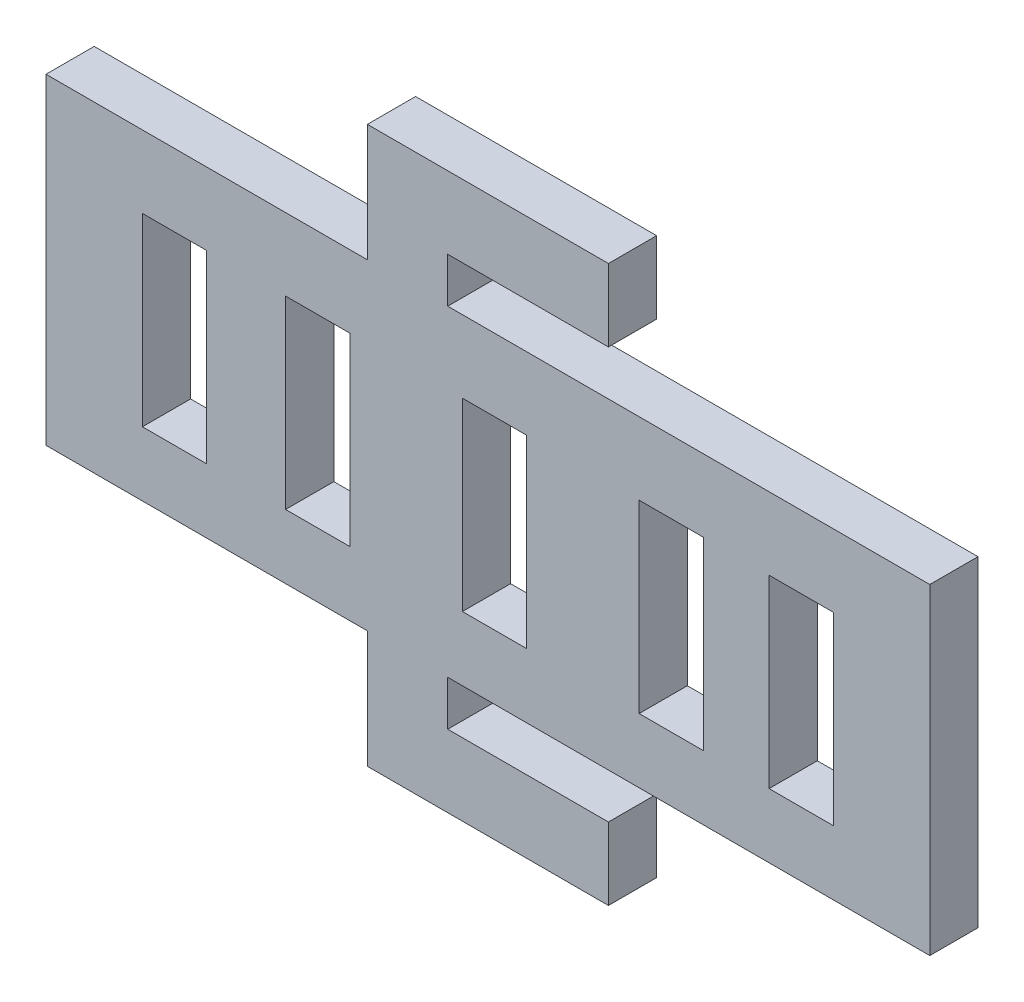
from build123d import *

# Parameters (mm, degrees)
SKETCH1_W           = 55
SKETCH1_H           = 20
SKETCH1_W_2         = 4
SKETCH1_H_2         = 11.5
BOSS_EXTRUDE1_DEPTH = 3


with BuildPart() as part:
    # Sketch1 → Boss-Extrude1 (new body)
    # profile 1 of 3: a face of its own
    with BuildSketch(Plane.XY):
        Rectangle(SKETCH1_W, SKETCH1_H)
        with Locations((-19.5, -0.25)):
            Rectangle(SKETCH1_W_2, SKETCH1_H_2, mode=Mode.SUBTRACT)
        with Locations((-10.58791266, -0.25)):
            Rectangle(SKETCH1_W_2, SKETCH1_H_2, mode=Mode.SUBTRACT)
        with Locations((0.41208734, -0.25)):
            Rectangle(SKETCH1_W_2, SKETCH1_H_2, mode=Mode.SUBTRACT)
        with Locations((11.41208734, -0.25)):
            Rectangle(SKETCH1_W_2, SKETCH1_H_2, mode=Mode.SUBTRACT)
        with Locations((19.5, -0.25)):
            Rectangle(SKETCH1_W_2, SKETCH1_H_2, mode=Mode.SUBTRACT)
    # profile 2 of 3: a face of its own
    with BuildSketch(Plane.XY):
        Polygon((-7.5, 17.3), (-7.5, 10), (-2.5, 10), (-2.5, 12.8), (7.5, 12.8), (7.5, 17.3), align=None)
    # profile 3 of 3: a face of its own
    with BuildSketch(Plane.XY):
        Polygon((-2.5, -10), (-7.5, -10), (-7.5, -17.3), (7.5, -17.3), (7.5, -12.8), (-2.5, -12.8), align=None)
    extrude(amount=BOSS_EXTRUDE1_DEPTH)


solid = part.part
